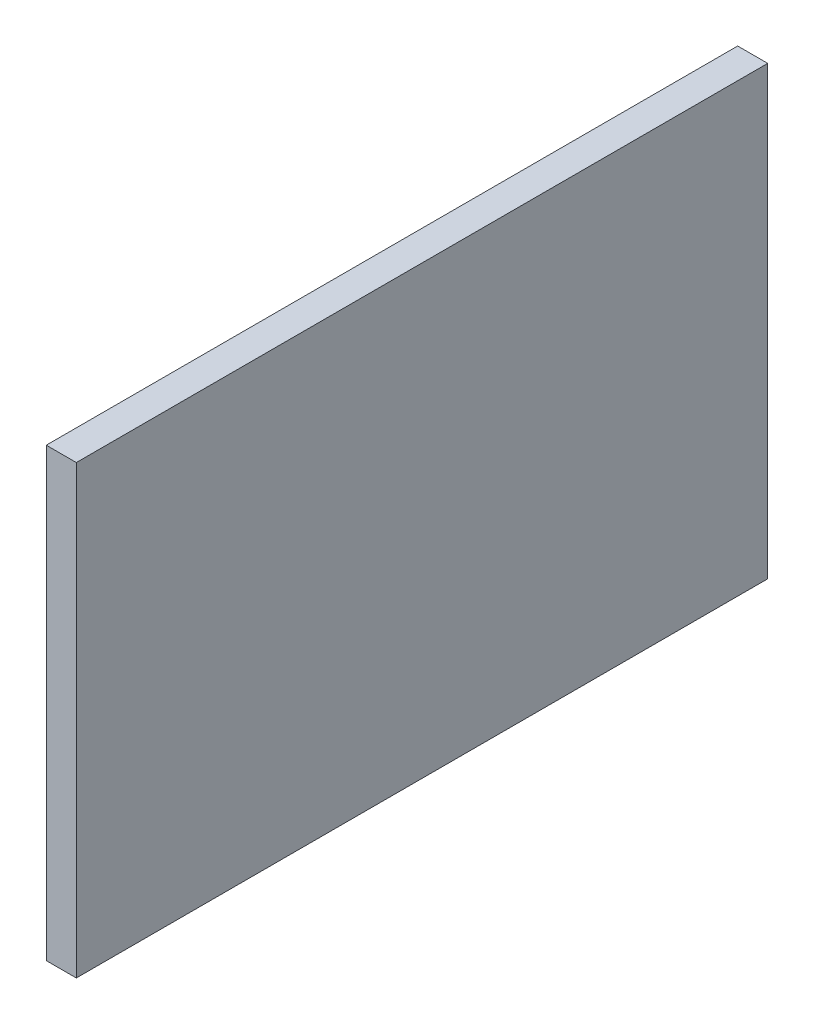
ISO-10303-21;
HEADER;
FILE_DESCRIPTION(('STEP AP214'),'2;1');
FILE_NAME('part.step','',(''),(''),'','','');
FILE_SCHEMA(('AUTOMOTIVE_DESIGN { 1 0 10303 214 1 1 1 1 }'));
ENDSEC;
DATA;
#1=APPLICATION_CONTEXT('core data for automotive mechanical design processes');
#2=APPLICATION_PROTOCOL_DEFINITION('international standard','automotive_design',2000,#1);
#3=PRODUCT_CONTEXT('',#1,'mechanical');
#4=PRODUCT('Part','Part','',(#3));
#5=PRODUCT_RELATED_PRODUCT_CATEGORY('part','',(#4));
#6=PRODUCT_DEFINITION_FORMATION('','',#4);
#7=PRODUCT_DEFINITION_CONTEXT('part definition',#1,'design');
#8=PRODUCT_DEFINITION('design','',#6,#7);
#9=PRODUCT_DEFINITION_SHAPE('','',#8);
#10=(LENGTH_UNIT() NAMED_UNIT(*) SI_UNIT(.MILLI.,.METRE.));
#11=(NAMED_UNIT(*) PLANE_ANGLE_UNIT() SI_UNIT($,.RADIAN.));
#12=(NAMED_UNIT(*) SI_UNIT($,.STERADIAN.) SOLID_ANGLE_UNIT());
#13=UNCERTAINTY_MEASURE_WITH_UNIT(LENGTH_MEASURE(1.E-05),#10,'distance_accuracy_value','');
#14=(GEOMETRIC_REPRESENTATION_CONTEXT(3) GLOBAL_UNCERTAINTY_ASSIGNED_CONTEXT((#13)) GLOBAL_UNIT_ASSIGNED_CONTEXT((#10,
#11,#12)) REPRESENTATION_CONTEXT('',''));
#15=CARTESIAN_POINT('',(0.,0.,0.));
#16=DIRECTION('',(0.,0.,1.));
#17=DIRECTION('',(1.,0.,0.));
#18=AXIS2_PLACEMENT_3D('',#15,#16,#17);
#19=CARTESIAN_POINT('',(40.,0.,0.));
#20=DIRECTION('',(0.,0.,-1.));
#21=DIRECTION('',(-1.,0.,0.));
#22=AXIS2_PLACEMENT_3D('',#19,#20,#21);
#23=PLANE('',#22);
#24=DIRECTION('',(0.,-1.,0.));
#25=VECTOR('',#24,1.);
#26=CARTESIAN_POINT('',(0.,0.,0.));
#27=LINE('',#26,#25);
#28=CARTESIAN_POINT('',(0.,594.,0.));
#29=VERTEX_POINT('',#28);
#30=CARTESIAN_POINT('',(0.,0.,0.));
#31=VERTEX_POINT('',#30);
#32=EDGE_CURVE('E113',#29,#31,#27,.T.);
#33=ORIENTED_EDGE('',*,*,#32,.T.);
#34=DIRECTION('',(-1.,0.,0.));
#35=VECTOR('',#34,1.);
#36=CARTESIAN_POINT('',(40.,0.,0.));
#37=LINE('',#36,#35);
#38=CARTESIAN_POINT('',(40.,0.,0.));
#39=VERTEX_POINT('',#38);
#40=EDGE_CURVE('E11',#39,#31,#37,.T.);
#41=ORIENTED_EDGE('',*,*,#40,.F.);
#42=DIRECTION('',(0.,-1.,0.));
#43=VECTOR('',#42,1.);
#44=CARTESIAN_POINT('',(40.,0.,0.));
#45=LINE('',#44,#43);
#46=CARTESIAN_POINT('',(40.,594.,0.));
#47=VERTEX_POINT('',#46);
#48=EDGE_CURVE('E97',#47,#39,#45,.T.);
#49=ORIENTED_EDGE('',*,*,#48,.F.);
#50=DIRECTION('',(-1.,0.,0.));
#51=VECTOR('',#50,1.);
#52=CARTESIAN_POINT('',(40.,594.,0.));
#53=LINE('',#52,#51);
#54=EDGE_CURVE('E109',#47,#29,#53,.T.);
#55=ORIENTED_EDGE('',*,*,#54,.T.);
#56=EDGE_LOOP('',(#33,#41,#49,#55));
#57=FACE_BOUND('',#56,.T.);
#58=ADVANCED_FACE('F45',(#57),#23,.F.);
#59=CARTESIAN_POINT('',(40.,0.,0.));
#60=DIRECTION('',(0.,1.,0.));
#61=DIRECTION('',(0.,0.,1.));
#62=AXIS2_PLACEMENT_3D('',#59,#60,#61);
#63=PLANE('',#62);
#64=DIRECTION('',(0.,0.,-1.));
#65=VECTOR('',#64,1.);
#66=CARTESIAN_POINT('',(0.,0.,0.));
#67=LINE('',#66,#65);
#68=CARTESIAN_POINT('',(0.,0.,-920.));
#69=VERTEX_POINT('',#68);
#70=EDGE_CURVE('E102',#31,#69,#67,.T.);
#71=ORIENTED_EDGE('',*,*,#70,.T.);
#72=DIRECTION('',(-1.,0.,0.));
#73=VECTOR('',#72,1.);
#74=CARTESIAN_POINT('',(40.,0.,-920.));
#75=LINE('',#74,#73);
#76=CARTESIAN_POINT('',(40.,0.,-920.));
#77=VERTEX_POINT('',#76);
#78=EDGE_CURVE('E54',#77,#69,#75,.T.);
#79=ORIENTED_EDGE('',*,*,#78,.F.);
#80=DIRECTION('',(0.,0.,-1.));
#81=VECTOR('',#80,1.);
#82=CARTESIAN_POINT('',(40.,0.,0.));
#83=LINE('',#82,#81);
#84=EDGE_CURVE('E92',#39,#77,#83,.T.);
#85=ORIENTED_EDGE('',*,*,#84,.F.);
#86=ORIENTED_EDGE('',*,*,#40,.T.);
#87=EDGE_LOOP('',(#71,#79,#85,#86));
#88=FACE_BOUND('',#87,.T.);
#89=ADVANCED_FACE('F101',(#88),#63,.F.);
#90=CARTESIAN_POINT('',(40.,0.,-920.));
#91=DIRECTION('',(0.,0.,1.));
#92=DIRECTION('',(1.,0.,0.));
#93=AXIS2_PLACEMENT_3D('',#90,#91,#92);
#94=PLANE('',#93);
#95=DIRECTION('',(0.,1.,0.));
#96=VECTOR('',#95,1.);
#97=CARTESIAN_POINT('',(0.,0.,-920.));
#98=LINE('',#97,#96);
#99=CARTESIAN_POINT('',(0.,594.,-920.));
#100=VERTEX_POINT('',#99);
#101=EDGE_CURVE('E79',#69,#100,#98,.T.);
#102=ORIENTED_EDGE('',*,*,#101,.T.);
#103=DIRECTION('',(-1.,0.,0.));
#104=VECTOR('',#103,1.);
#105=CARTESIAN_POINT('',(40.,594.,-920.));
#106=LINE('',#105,#104);
#107=CARTESIAN_POINT('',(40.,594.,-920.));
#108=VERTEX_POINT('',#107);
#109=EDGE_CURVE('E104',#108,#100,#106,.T.);
#110=ORIENTED_EDGE('',*,*,#109,.F.);
#111=DIRECTION('',(0.,1.,0.));
#112=VECTOR('',#111,1.);
#113=CARTESIAN_POINT('',(40.,0.,-920.));
#114=LINE('',#113,#112);
#115=EDGE_CURVE('E95',#77,#108,#114,.T.);
#116=ORIENTED_EDGE('',*,*,#115,.F.);
#117=ORIENTED_EDGE('',*,*,#78,.T.);
#118=EDGE_LOOP('',(#102,#110,#116,#117));
#119=FACE_BOUND('',#118,.T.);
#120=ADVANCED_FACE('F105',(#119),#94,.F.);
#121=CARTESIAN_POINT('',(40.,594.,0.));
#122=DIRECTION('',(0.,-1.,0.));
#123=DIRECTION('',(0.,0.,-1.));
#124=AXIS2_PLACEMENT_3D('',#121,#122,#123);
#125=PLANE('',#124);
#126=DIRECTION('',(0.,0.,1.));
#127=VECTOR('',#126,1.);
#128=CARTESIAN_POINT('',(0.,594.,0.));
#129=LINE('',#128,#127);
#130=EDGE_CURVE('E85',#100,#29,#129,.T.);
#131=ORIENTED_EDGE('',*,*,#130,.T.);
#132=ORIENTED_EDGE('',*,*,#54,.F.);
#133=DIRECTION('',(0.,0.,1.));
#134=VECTOR('',#133,1.);
#135=CARTESIAN_POINT('',(40.,594.,0.));
#136=LINE('',#135,#134);
#137=EDGE_CURVE('E62',#108,#47,#136,.T.);
#138=ORIENTED_EDGE('',*,*,#137,.F.);
#139=ORIENTED_EDGE('',*,*,#109,.T.);
#140=EDGE_LOOP('',(#131,#132,#138,#139));
#141=FACE_BOUND('',#140,.T.);
#142=ADVANCED_FACE('F126',(#141),#125,.F.);
#143=CARTESIAN_POINT('',(40.,0.,0.));
#144=DIRECTION('',(-1.,0.,0.));
#145=DIRECTION('',(0.,0.,1.));
#146=AXIS2_PLACEMENT_3D('',#143,#144,#145);
#147=PLANE('',#146);
#148=ORIENTED_EDGE('',*,*,#48,.T.);
#149=ORIENTED_EDGE('',*,*,#84,.T.);
#150=ORIENTED_EDGE('',*,*,#115,.T.);
#151=ORIENTED_EDGE('',*,*,#137,.T.);
#152=EDGE_LOOP('',(#148,#149,#150,#151));
#153=FACE_BOUND('',#152,.T.);
#154=ADVANCED_FACE('F93',(#153),#147,.F.);
#155=CARTESIAN_POINT('',(0.,0.,0.));
#156=DIRECTION('',(-1.,0.,0.));
#157=DIRECTION('',(0.,0.,1.));
#158=AXIS2_PLACEMENT_3D('',#155,#156,#157);
#159=PLANE('',#158);
#160=ORIENTED_EDGE('',*,*,#32,.F.);
#161=ORIENTED_EDGE('',*,*,#130,.F.);
#162=ORIENTED_EDGE('',*,*,#101,.F.);
#163=ORIENTED_EDGE('',*,*,#70,.F.);
#164=EDGE_LOOP('',(#160,#161,#162,#163));
#165=FACE_BOUND('',#164,.T.);
#166=ADVANCED_FACE('F129',(#165),#159,.T.);
#167=CLOSED_SHELL('',(#58,#89,#120,#142,#154,#166));
#168=MANIFOLD_SOLID_BREP('B2',#167);
#169=ADVANCED_BREP_SHAPE_REPRESENTATION('',(#18,#168),#14);
#170=SHAPE_DEFINITION_REPRESENTATION(#9,#169);
ENDSEC;
END-ISO-10303-21;
